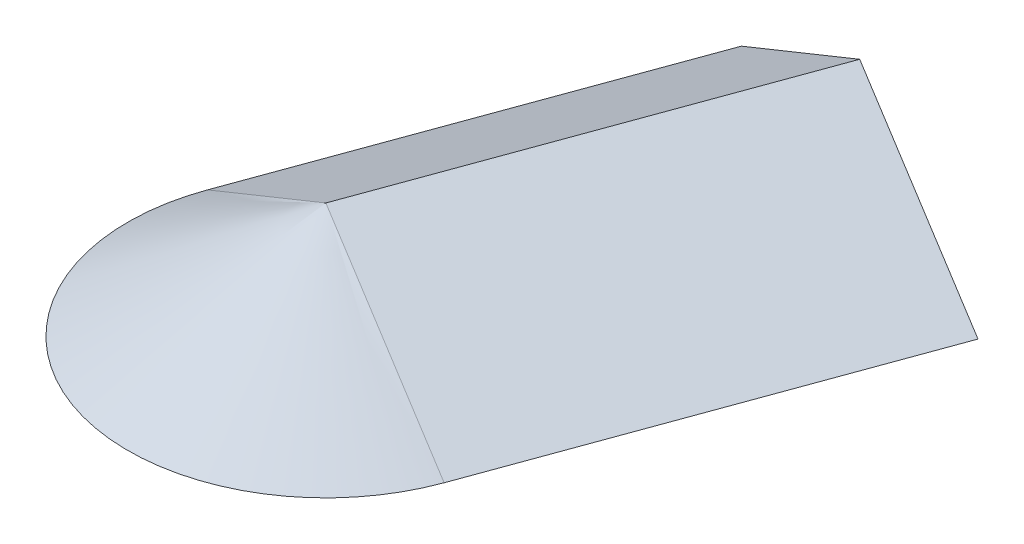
ISO-10303-21;
HEADER;
FILE_DESCRIPTION(('STEP AP214'),'2;1');
FILE_NAME('part.step','',(''),(''),'','','');
FILE_SCHEMA(('AUTOMOTIVE_DESIGN { 1 0 10303 214 1 1 1 1 }'));
ENDSEC;
DATA;
#1=APPLICATION_CONTEXT('core data for automotive mechanical design processes');
#2=APPLICATION_PROTOCOL_DEFINITION('international standard','automotive_design',2000,#1);
#3=PRODUCT_CONTEXT('',#1,'mechanical');
#4=PRODUCT('Part','Part','',(#3));
#5=PRODUCT_RELATED_PRODUCT_CATEGORY('part','',(#4));
#6=PRODUCT_DEFINITION_FORMATION('','',#4);
#7=PRODUCT_DEFINITION_CONTEXT('part definition',#1,'design');
#8=PRODUCT_DEFINITION('design','',#6,#7);
#9=PRODUCT_DEFINITION_SHAPE('','',#8);
#10=(LENGTH_UNIT() NAMED_UNIT(*) SI_UNIT(.MILLI.,.METRE.));
#11=(NAMED_UNIT(*) PLANE_ANGLE_UNIT() SI_UNIT($,.RADIAN.));
#12=(NAMED_UNIT(*) SI_UNIT($,.STERADIAN.) SOLID_ANGLE_UNIT());
#13=UNCERTAINTY_MEASURE_WITH_UNIT(LENGTH_MEASURE(1.E-05),#10,'distance_accuracy_value','');
#14=(GEOMETRIC_REPRESENTATION_CONTEXT(3) GLOBAL_UNCERTAINTY_ASSIGNED_CONTEXT((#13)) GLOBAL_UNIT_ASSIGNED_CONTEXT((#10,
#11,#12)) REPRESENTATION_CONTEXT('',''));
#15=CARTESIAN_POINT('',(0.,0.,0.));
#16=DIRECTION('',(0.,0.,1.));
#17=DIRECTION('',(1.,0.,0.));
#18=AXIS2_PLACEMENT_3D('',#15,#16,#17);
#19=CARTESIAN_POINT('',(0.,15.3566048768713,0.));
#20=DIRECTION('',(0.,-1.,0.));
#21=DIRECTION('',(0.,0.,-1.));
#22=AXIS2_PLACEMENT_3D('',#19,#20,#21);
#23=CONICAL_SURFACE('',#22,0.,1.04272187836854);
#24=DIRECTION('',(0.81168665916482,0.503871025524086,0.295429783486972));
#25=VECTOR('',#24,1.);
#26=CARTESIAN_POINT('',(-24.7379799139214,0.,-9.00388834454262));
#27=LINE('',#26,#25);
#28=CARTESIAN_POINT('',(-24.7379799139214,0.,-9.00388834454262));
#29=VERTEX_POINT('',#28);
#30=CARTESIAN_POINT('',(0.,15.3566048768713,0.));
#31=VERTEX_POINT('',#30);
#32=EDGE_CURVE('E46',#29,#31,#27,.T.);
#33=ORIENTED_EDGE('',*,*,#32,.F.);
#34=CARTESIAN_POINT('',(0.,0.,0.));
#35=DIRECTION('',(0.,1.,0.));
#36=DIRECTION('',(0.,0.,1.));
#37=AXIS2_PLACEMENT_3D('',#34,#35,#36);
#38=CIRCLE('',#37,26.3256083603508);
#39=CARTESIAN_POINT('',(24.7379799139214,0.,9.00388834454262));
#40=VERTEX_POINT('',#39);
#41=EDGE_CURVE('E11',#29,#40,#38,.T.);
#42=ORIENTED_EDGE('',*,*,#41,.T.);
#43=DIRECTION('',(0.81168665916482,-0.503871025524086,0.295429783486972));
#44=VECTOR('',#43,1.);
#45=CARTESIAN_POINT('',(0.,15.3566048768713,0.));
#46=LINE('',#45,#44);
#47=EDGE_CURVE('E50',#31,#40,#46,.T.);
#48=ORIENTED_EDGE('',*,*,#47,.F.);
#49=EDGE_LOOP('',(#33,#42,#48));
#50=FACE_BOUND('',#49,.T.);
#51=ADVANCED_FACE('F33',(#50),#23,.T.);
#52=CARTESIAN_POINT('',(-26.3256083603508,0.,0.));
#53=DIRECTION('',(0.,-1.,0.));
#54=DIRECTION('',(0.,0.,-1.));
#55=AXIS2_PLACEMENT_3D('',#52,#53,#54);
#56=PLANE('',#55);
#57=ORIENTED_EDGE('',*,*,#41,.F.);
#58=DIRECTION('',(-0.34202014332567,0.,0.939692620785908));
#59=VECTOR('',#58,1.);
#60=CARTESIAN_POINT('',(-5.79006397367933,0.,-61.062859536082));
#61=LINE('',#60,#59);
#62=CARTESIAN_POINT('',(-5.79006397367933,0.,-61.062859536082));
#63=VERTEX_POINT('',#62);
#64=EDGE_CURVE('E69',#63,#29,#61,.T.);
#65=ORIENTED_EDGE('',*,*,#64,.F.);
#66=DIRECTION('',(-0.939692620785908,0.,-0.34202014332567));
#67=VECTOR('',#66,1.);
#68=CARTESIAN_POINT('',(43.6858958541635,0.,-43.0550828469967));
#69=LINE('',#68,#67);
#70=CARTESIAN_POINT('',(43.6858958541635,0.,-43.0550828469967));
#71=VERTEX_POINT('',#70);
#72=EDGE_CURVE('E64',#71,#63,#69,.T.);
#73=ORIENTED_EDGE('',*,*,#72,.F.);
#74=DIRECTION('',(-0.34202014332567,0.,0.939692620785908));
#75=VECTOR('',#74,1.);
#76=CARTESIAN_POINT('',(43.6858958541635,0.,-43.0550828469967));
#77=LINE('',#76,#75);
#78=EDGE_CURVE('E40',#71,#40,#77,.T.);
#79=ORIENTED_EDGE('',*,*,#78,.T.);
#80=EDGE_LOOP('',(#57,#65,#73,#79));
#81=FACE_BOUND('',#80,.T.);
#82=ADVANCED_FACE('F66',(#81),#56,.T.);
#83=CARTESIAN_POINT('',(18.9479159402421,15.3566048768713,-52.0589711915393));
#84=DIRECTION('',(-0.473483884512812,-0.863778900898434,-0.1723340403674));
#85=DIRECTION('',(0.876898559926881,-0.48067547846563,0.));
#86=AXIS2_PLACEMENT_3D('',#83,#84,#85);
#87=PLANE('',#86);
#88=ORIENTED_EDGE('',*,*,#47,.T.);
#89=ORIENTED_EDGE('',*,*,#78,.F.);
#90=DIRECTION('',(0.81168665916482,-0.503871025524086,0.295429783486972));
#91=VECTOR('',#90,1.);
#92=CARTESIAN_POINT('',(18.9479159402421,15.3566048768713,-52.0589711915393));
#93=LINE('',#92,#91);
#94=CARTESIAN_POINT('',(18.9479159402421,15.3566048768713,-52.0589711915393));
#95=VERTEX_POINT('',#94);
#96=EDGE_CURVE('E73',#95,#71,#93,.T.);
#97=ORIENTED_EDGE('',*,*,#96,.F.);
#98=DIRECTION('',(-0.34202014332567,0.,0.939692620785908));
#99=VECTOR('',#98,1.);
#100=CARTESIAN_POINT('',(18.9479159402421,15.3566048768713,-52.0589711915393));
#101=LINE('',#100,#99);
#102=EDGE_CURVE('E82',#95,#31,#101,.T.);
#103=ORIENTED_EDGE('',*,*,#102,.T.);
#104=EDGE_LOOP('',(#88,#89,#97,#103));
#105=FACE_BOUND('',#104,.T.);
#106=ADVANCED_FACE('F81',(#105),#87,.F.);
#107=CARTESIAN_POINT('',(-5.79006397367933,0.,-61.062859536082));
#108=DIRECTION('',(0.473483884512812,-0.863778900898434,0.1723340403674));
#109=DIRECTION('',(0.876898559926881,0.48067547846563,0.));
#110=AXIS2_PLACEMENT_3D('',#107,#108,#109);
#111=PLANE('',#110);
#112=ORIENTED_EDGE('',*,*,#32,.T.);
#113=ORIENTED_EDGE('',*,*,#102,.F.);
#114=DIRECTION('',(0.81168665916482,0.503871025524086,0.295429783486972));
#115=VECTOR('',#114,1.);
#116=CARTESIAN_POINT('',(-5.79006397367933,0.,-61.062859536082));
#117=LINE('',#116,#115);
#118=EDGE_CURVE('E72',#63,#95,#117,.T.);
#119=ORIENTED_EDGE('',*,*,#118,.F.);
#120=ORIENTED_EDGE('',*,*,#64,.T.);
#121=EDGE_LOOP('',(#112,#113,#119,#120));
#122=FACE_BOUND('',#121,.T.);
#123=ADVANCED_FACE('F89',(#122),#111,.F.);
#124=CARTESIAN_POINT('',(18.9479159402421,15.3566048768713,-52.0589711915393));
#125=DIRECTION('',(-0.34202014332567,0.,0.939692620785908));
#126=DIRECTION('',(0.939692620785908,0.,0.34202014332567));
#127=AXIS2_PLACEMENT_3D('',#124,#125,#126);
#128=PLANE('',#127);
#129=ORIENTED_EDGE('',*,*,#96,.T.);
#130=ORIENTED_EDGE('',*,*,#72,.T.);
#131=ORIENTED_EDGE('',*,*,#118,.T.);
#132=EDGE_LOOP('',(#129,#130,#131));
#133=FACE_BOUND('',#132,.T.);
#134=ADVANCED_FACE('F76',(#133),#128,.F.);
#135=CLOSED_SHELL('',(#51,#82,#106,#123,#134));
#136=MANIFOLD_SOLID_BREP('B2',#135);
#137=ADVANCED_BREP_SHAPE_REPRESENTATION('',(#18,#136),#14);
#138=SHAPE_DEFINITION_REPRESENTATION(#9,#137);
ENDSEC;
END-ISO-10303-21;
